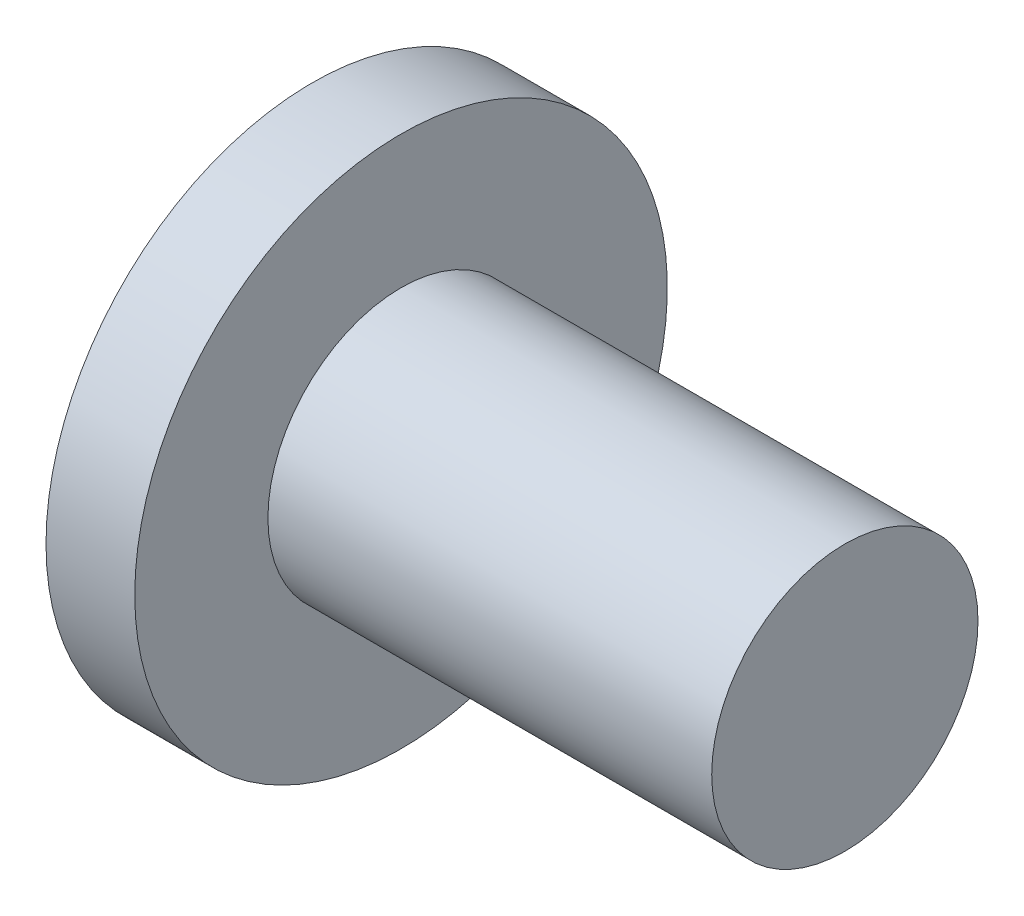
ISO-10303-21;
HEADER;
FILE_DESCRIPTION(('STEP AP214'),'2;1');
FILE_NAME('part.step','',(''),(''),'','','');
FILE_SCHEMA(('AUTOMOTIVE_DESIGN { 1 0 10303 214 1 1 1 1 }'));
ENDSEC;
DATA;
#1=APPLICATION_CONTEXT('core data for automotive mechanical design processes');
#2=APPLICATION_PROTOCOL_DEFINITION('international standard','automotive_design',2000,#1);
#3=PRODUCT_CONTEXT('',#1,'mechanical');
#4=PRODUCT('Part','Part','',(#3));
#5=PRODUCT_RELATED_PRODUCT_CATEGORY('part','',(#4));
#6=PRODUCT_DEFINITION_FORMATION('','',#4);
#7=PRODUCT_DEFINITION_CONTEXT('part definition',#1,'design');
#8=PRODUCT_DEFINITION('design','',#6,#7);
#9=PRODUCT_DEFINITION_SHAPE('','',#8);
#10=(LENGTH_UNIT() NAMED_UNIT(*) SI_UNIT(.MILLI.,.METRE.));
#11=(NAMED_UNIT(*) PLANE_ANGLE_UNIT() SI_UNIT($,.RADIAN.));
#12=(NAMED_UNIT(*) SI_UNIT($,.STERADIAN.) SOLID_ANGLE_UNIT());
#13=UNCERTAINTY_MEASURE_WITH_UNIT(LENGTH_MEASURE(1.E-05),#10,'distance_accuracy_value','');
#14=(GEOMETRIC_REPRESENTATION_CONTEXT(3) GLOBAL_UNCERTAINTY_ASSIGNED_CONTEXT((#13)) GLOBAL_UNIT_ASSIGNED_CONTEXT((#10,
#11,#12)) REPRESENTATION_CONTEXT('',''));
#15=CARTESIAN_POINT('',(0.,0.,0.));
#16=DIRECTION('',(0.,0.,1.));
#17=DIRECTION('',(1.,0.,0.));
#18=AXIS2_PLACEMENT_3D('',#15,#16,#17);
#19=CARTESIAN_POINT('',(-1.9830383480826,4.5,0.));
#20=DIRECTION('',(-1.,0.,0.));
#21=DIRECTION('',(0.,0.,1.));
#22=AXIS2_PLACEMENT_3D('',#19,#20,#21);
#23=PLANE('',#22);
#24=CARTESIAN_POINT('',(-1.9830383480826,0.,0.));
#25=DIRECTION('',(-1.,0.,0.));
#26=DIRECTION('',(0.,0.,1.));
#27=AXIS2_PLACEMENT_3D('',#24,#25,#26);
#28=CIRCLE('',#27,4.5);
#29=CARTESIAN_POINT('',(-1.9830383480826,0.,4.5));
#30=VERTEX_POINT('',#29);
#31=EDGE_CURVE('E10',#30,#30,#28,.T.);
#32=ORIENTED_EDGE('',*,*,#31,.F.);
#33=EDGE_LOOP('',(#32));
#34=FACE_BOUND('',#33,.T.);
#35=CARTESIAN_POINT('',(-1.9830383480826,0.,0.));
#36=DIRECTION('',(-1.,0.,0.));
#37=DIRECTION('',(0.,0.,1.));
#38=AXIS2_PLACEMENT_3D('',#35,#36,#37);
#39=CIRCLE('',#38,2.25);
#40=CARTESIAN_POINT('',(-1.9830383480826,0.,2.25));
#41=VERTEX_POINT('',#40);
#42=EDGE_CURVE('E53',#41,#41,#39,.T.);
#43=ORIENTED_EDGE('',*,*,#42,.T.);
#44=EDGE_LOOP('',(#43));
#45=FACE_BOUND('',#44,.T.);
#46=ADVANCED_FACE('F36',(#34,#45),#23,.F.);
#47=CARTESIAN_POINT('',(-5.56976401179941,0.,0.));
#48=DIRECTION('',(-1.,0.,0.));
#49=DIRECTION('',(0.,0.,1.));
#50=AXIS2_PLACEMENT_3D('',#47,#48,#49);
#51=CYLINDRICAL_SURFACE('',#50,4.5);
#52=CARTESIAN_POINT('',(-3.4830383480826,0.,0.));
#53=DIRECTION('',(-1.,0.,0.));
#54=DIRECTION('',(0.,0.,1.));
#55=AXIS2_PLACEMENT_3D('',#52,#53,#54);
#56=CIRCLE('',#55,4.5);
#57=CARTESIAN_POINT('',(-3.4830383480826,0.,4.5));
#58=VERTEX_POINT('',#57);
#59=EDGE_CURVE('E43',#58,#58,#56,.T.);
#60=ORIENTED_EDGE('',*,*,#59,.F.);
#61=EDGE_LOOP('',(#60));
#62=FACE_BOUND('',#61,.T.);
#63=ORIENTED_EDGE('',*,*,#31,.T.);
#64=EDGE_LOOP('',(#63));
#65=FACE_BOUND('',#64,.T.);
#66=ADVANCED_FACE('F74',(#62,#65),#51,.T.);
#67=CARTESIAN_POINT('',(-3.4830383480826,4.5,0.));
#68=DIRECTION('',(1.,0.,0.));
#69=DIRECTION('',(0.,0.,-1.));
#70=AXIS2_PLACEMENT_3D('',#67,#68,#69);
#71=PLANE('',#70);
#72=ORIENTED_EDGE('',*,*,#59,.T.);
#73=EDGE_LOOP('',(#72));
#74=FACE_BOUND('',#73,.T.);
#75=ADVANCED_FACE('F69',(#74),#71,.F.);
#76=CARTESIAN_POINT('',(5.5169616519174,2.25,0.));
#77=DIRECTION('',(-1.,0.,0.));
#78=DIRECTION('',(0.,0.,1.));
#79=AXIS2_PLACEMENT_3D('',#76,#77,#78);
#80=PLANE('',#79);
#81=CARTESIAN_POINT('',(5.5169616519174,0.,0.));
#82=DIRECTION('',(-1.,0.,0.));
#83=DIRECTION('',(0.,0.,1.));
#84=AXIS2_PLACEMENT_3D('',#81,#82,#83);
#85=CIRCLE('',#84,2.25);
#86=CARTESIAN_POINT('',(5.5169616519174,0.,2.25));
#87=VERTEX_POINT('',#86);
#88=EDGE_CURVE('E48',#87,#87,#85,.T.);
#89=ORIENTED_EDGE('',*,*,#88,.F.);
#90=EDGE_LOOP('',(#89));
#91=FACE_BOUND('',#90,.T.);
#92=ADVANCED_FACE('F64',(#91),#80,.F.);
#93=CARTESIAN_POINT('',(-5.56976401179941,0.,0.));
#94=DIRECTION('',(-1.,0.,0.));
#95=DIRECTION('',(0.,0.,1.));
#96=AXIS2_PLACEMENT_3D('',#93,#94,#95);
#97=CYLINDRICAL_SURFACE('',#96,2.25);
#98=ORIENTED_EDGE('',*,*,#42,.F.);
#99=EDGE_LOOP('',(#98));
#100=FACE_BOUND('',#99,.T.);
#101=ORIENTED_EDGE('',*,*,#88,.T.);
#102=EDGE_LOOP('',(#101));
#103=FACE_BOUND('',#102,.T.);
#104=ADVANCED_FACE('F61',(#100,#103),#97,.T.);
#105=CLOSED_SHELL('',(#46,#66,#75,#92,#104));
#106=MANIFOLD_SOLID_BREP('B2',#105);
#107=ADVANCED_BREP_SHAPE_REPRESENTATION('',(#18,#106),#14);
#108=SHAPE_DEFINITION_REPRESENTATION(#9,#107);
ENDSEC;
END-ISO-10303-21;
